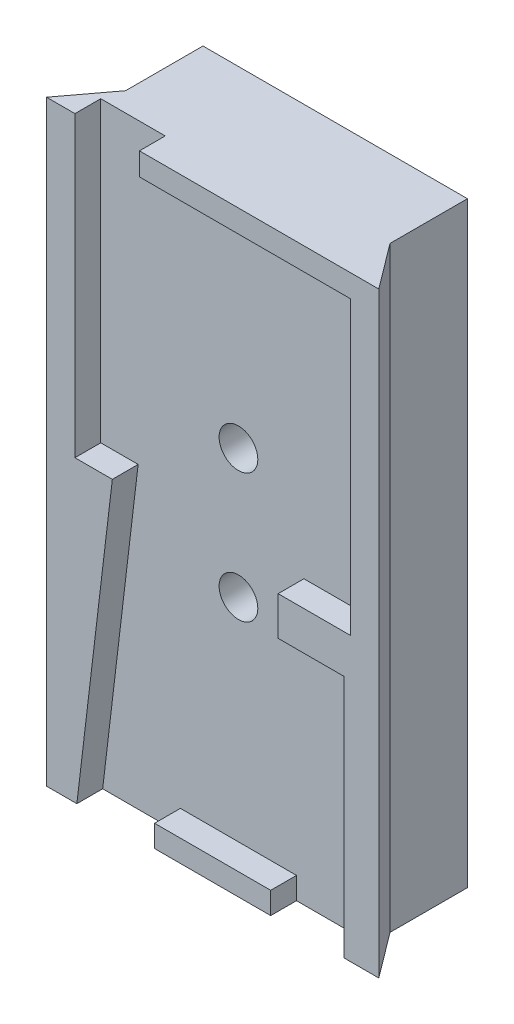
from build123d import *

# Parameters (mm, degrees)
EXTRUDE_1_DEPTH     = 92.5
CUT_EXTRUDE_1_DEPTH = 4
SKETCH_4_R          = 3
CUT_EXTRUDE_2_DEPTH = 98.18185273


with BuildPart() as part:
    # Sketch 1 → Extrude 1 (new body)
    with BuildSketch(Plane(origin=(0, 0, 0), x_dir=(1, 0, 0), z_dir=(0, 1, 0))):
        Polygon((-20.5, 0), (20.5, 0), (20.5, -12), (25.75, -19), (-25.75, -19), (-20.5, -12), align=None)
    extrude(amount=EXTRUDE_1_DEPTH)

    # Sketch 2 → Cut-Extrude 1 (cut)
    with BuildSketch(Plane.XY.offset(19)):
        Polygon((-21.05, 0), (-15.55, 46.3), (-21.35, 46.3), (-21.35, 92.5), (-11.35, 92.5), (-11.35, 89), (21.35, 89), (21.35, 43.8), (10.15, 43.8), (10.15, 37.8), (20.35, 37.8), (20.35, 0), (9, 0), (9, 3.4), (-9, 3.4), (-9, 0), align=None)
    extrude(amount=-CUT_EXTRUDE_1_DEPTH, mode=Mode.SUBTRACT)

    # Sketch 4 → Cut-Extrude 2 (cut, through all)
    with BuildSketch(Plane.XY.offset(15)):
        with Locations((0, 56.25)):
            Circle(SKETCH_4_R)
        with Locations((0, 36.25)):
            Circle(SKETCH_4_R)
    extrude(amount=-CUT_EXTRUDE_2_DEPTH, mode=Mode.SUBTRACT)


solid = part.part
